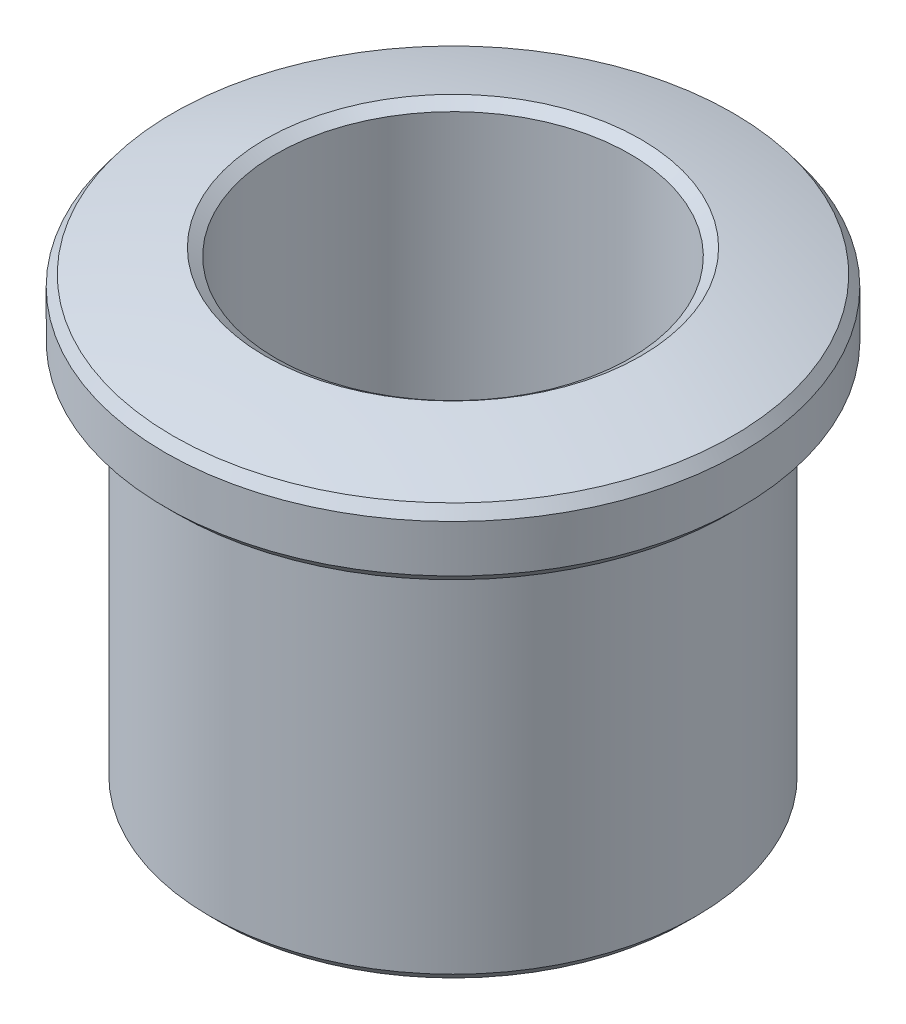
ISO-10303-21;
HEADER;
FILE_DESCRIPTION(('STEP AP214'),'2;1');
FILE_NAME('part.step','',(''),(''),'','','');
FILE_SCHEMA(('AUTOMOTIVE_DESIGN { 1 0 10303 214 1 1 1 1 }'));
ENDSEC;
DATA;
#1=APPLICATION_CONTEXT('core data for automotive mechanical design processes');
#2=APPLICATION_PROTOCOL_DEFINITION('international standard','automotive_design',2000,#1);
#3=PRODUCT_CONTEXT('',#1,'mechanical');
#4=PRODUCT('Part','Part','',(#3));
#5=PRODUCT_RELATED_PRODUCT_CATEGORY('part','',(#4));
#6=PRODUCT_DEFINITION_FORMATION('','',#4);
#7=PRODUCT_DEFINITION_CONTEXT('part definition',#1,'design');
#8=PRODUCT_DEFINITION('design','',#6,#7);
#9=PRODUCT_DEFINITION_SHAPE('','',#8);
#10=(LENGTH_UNIT() NAMED_UNIT(*) SI_UNIT(.MILLI.,.METRE.));
#11=(NAMED_UNIT(*) PLANE_ANGLE_UNIT() SI_UNIT($,.RADIAN.));
#12=(NAMED_UNIT(*) SI_UNIT($,.STERADIAN.) SOLID_ANGLE_UNIT());
#13=UNCERTAINTY_MEASURE_WITH_UNIT(LENGTH_MEASURE(1.E-05),#10,'distance_accuracy_value','');
#14=(GEOMETRIC_REPRESENTATION_CONTEXT(3) GLOBAL_UNCERTAINTY_ASSIGNED_CONTEXT((#13)) GLOBAL_UNIT_ASSIGNED_CONTEXT((#10,
#11,#12)) REPRESENTATION_CONTEXT('',''));
#15=CARTESIAN_POINT('',(0.,0.,0.));
#16=DIRECTION('',(0.,0.,1.));
#17=DIRECTION('',(1.,0.,0.));
#18=AXIS2_PLACEMENT_3D('',#15,#16,#17);
#19=CARTESIAN_POINT('',(0.,20.,0.));
#20=DIRECTION('',(0.,-1.,0.));
#21=DIRECTION('',(0.,0.,-1.));
#22=AXIS2_PLACEMENT_3D('',#19,#20,#21);
#23=CYLINDRICAL_SURFACE('',#22,13.);
#24=CARTESIAN_POINT('',(0.,17.5,0.));
#25=DIRECTION('',(0.,-1.,0.));
#26=DIRECTION('',(0.,0.,-1.));
#27=AXIS2_PLACEMENT_3D('',#24,#25,#26);
#28=CIRCLE('',#27,13.);
#29=CARTESIAN_POINT('',(0.,17.5,-13.));
#30=VERTEX_POINT('',#29);
#31=EDGE_CURVE('E56',#30,#30,#28,.F.);
#32=ORIENTED_EDGE('',*,*,#31,.T.);
#33=EDGE_LOOP('',(#32));
#34=FACE_BOUND('',#33,.T.);
#35=CARTESIAN_POINT('',(0.,19.6316890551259,0.));
#36=DIRECTION('',(0.,1.,0.));
#37=DIRECTION('',(0.,0.,1.));
#38=AXIS2_PLACEMENT_3D('',#35,#36,#37);
#39=CIRCLE('',#38,13.);
#40=CARTESIAN_POINT('',(0.,19.6316890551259,13.));
#41=VERTEX_POINT('',#40);
#42=EDGE_CURVE('E59',#41,#41,#39,.F.);
#43=ORIENTED_EDGE('',*,*,#42,.T.);
#44=EDGE_LOOP('',(#43));
#45=FACE_BOUND('',#44,.T.);
#46=ADVANCED_FACE('F27',(#34,#45),#23,.T.);
#47=CARTESIAN_POINT('',(0.,0.,0.));
#48=DIRECTION('',(0.,1.,0.));
#49=DIRECTION('',(0.,0.,1.));
#50=AXIS2_PLACEMENT_3D('',#47,#48,#49);
#51=PLANE('',#50);
#52=CARTESIAN_POINT('',(0.,0.,0.));
#53=DIRECTION('',(0.,1.,0.));
#54=DIRECTION('',(0.,0.,1.));
#55=AXIS2_PLACEMENT_3D('',#52,#53,#54);
#56=CIRCLE('',#55,10.5);
#57=CARTESIAN_POINT('',(0.,0.,10.5));
#58=VERTEX_POINT('',#57);
#59=EDGE_CURVE('E47',#58,#58,#56,.F.);
#60=ORIENTED_EDGE('',*,*,#59,.T.);
#61=EDGE_LOOP('',(#60));
#62=FACE_BOUND('',#61,.T.);
#63=CARTESIAN_POINT('',(0.,0.,0.));
#64=DIRECTION('',(0.,1.,0.));
#65=DIRECTION('',(0.,0.,1.));
#66=AXIS2_PLACEMENT_3D('',#63,#64,#65);
#67=CIRCLE('',#66,8.5);
#68=CARTESIAN_POINT('',(0.,0.,8.5));
#69=VERTEX_POINT('',#68);
#70=EDGE_CURVE('E50',#69,#69,#67,.T.);
#71=ORIENTED_EDGE('',*,*,#70,.T.);
#72=EDGE_LOOP('',(#71));
#73=FACE_BOUND('',#72,.T.);
#74=ADVANCED_FACE('F85',(#62,#73),#51,.F.);
#75=CARTESIAN_POINT('',(0.,-21.25,0.));
#76=DIRECTION('',(0.,0.,1.));
#77=DIRECTION('',(1.,0.,0.));
#78=AXIS2_PLACEMENT_3D('',#75,#76,#77);
#79=SPHERICAL_SURFACE('',#78,43.25);
#80=CARTESIAN_POINT('',(0.,-21.25,0.));
#81=DIRECTION('',(0.,-1.,0.));
#82=DIRECTION('',(0.,0.,-1.));
#83=AXIS2_PLACEMENT_3D('',#80,#81,#82);
#84=SPHERICAL_SURFACE('',#83,43.25);
#85=CARTESIAN_POINT('',(0.,21.1589112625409,0.));
#86=DIRECTION('',(0.,-1.,0.));
#87=DIRECTION('',(0.,0.,-1.));
#88=AXIS2_PLACEMENT_3D('',#85,#86,#87);
#89=CIRCLE('',#88,8.48803543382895);
#90=CARTESIAN_POINT('',(0.,21.1589112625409,-8.48803543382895));
#91=VERTEX_POINT('',#90);
#92=EDGE_CURVE('E10',#91,#91,#89,.T.);
#93=ORIENTED_EDGE('',*,*,#92,.T.);
#94=EDGE_LOOP('',(#93));
#95=FACE_BOUND('',#94,.T.);
#96=CARTESIAN_POINT('',(0.,20.1098374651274,0.));
#97=DIRECTION('',(0.,-1.,0.));
#98=DIRECTION('',(0.,0.,-1.));
#99=AXIS2_PLACEMENT_3D('',#96,#97,#98);
#100=CIRCLE('',#99,12.6461988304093);
#101=CARTESIAN_POINT('',(0.,20.1098374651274,-12.6461988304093));
#102=VERTEX_POINT('',#101);
#103=EDGE_CURVE('E53',#102,#102,#100,.F.);
#104=ORIENTED_EDGE('',*,*,#103,.T.);
#105=EDGE_LOOP('',(#104));
#106=FACE_BOUND('',#105,.T.);
#107=ADVANCED_FACE('F29',(#95,#106),#84,.T.);
#108=CARTESIAN_POINT('',(0.,0.,0.));
#109=DIRECTION('',(0.,-1.,0.));
#110=DIRECTION('',(0.,0.,-1.));
#111=AXIS2_PLACEMENT_3D('',#108,#109,#110);
#112=CYLINDRICAL_SURFACE('',#111,7.99999999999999);
#113=CARTESIAN_POINT('',(0.,20.8254896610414,0.));
#114=DIRECTION('',(0.,1.,0.));
#115=DIRECTION('',(0.,0.,1.));
#116=AXIS2_PLACEMENT_3D('',#113,#114,#115);
#117=CIRCLE('',#116,7.99999999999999);
#118=CARTESIAN_POINT('',(0.,20.8254896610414,7.99999999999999));
#119=VERTEX_POINT('',#118);
#120=EDGE_CURVE('E34',#119,#119,#117,.T.);
#121=ORIENTED_EDGE('',*,*,#120,.T.);
#122=EDGE_LOOP('',(#121));
#123=FACE_BOUND('',#122,.T.);
#124=CARTESIAN_POINT('',(0.,0.500000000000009,0.));
#125=DIRECTION('',(0.,1.,0.));
#126=DIRECTION('',(0.,0.,1.));
#127=AXIS2_PLACEMENT_3D('',#124,#125,#126);
#128=CIRCLE('',#127,7.99999999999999);
#129=CARTESIAN_POINT('',(0.,0.500000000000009,7.99999999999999));
#130=VERTEX_POINT('',#129);
#131=EDGE_CURVE('E38',#130,#130,#128,.F.);
#132=ORIENTED_EDGE('',*,*,#131,.T.);
#133=EDGE_LOOP('',(#132));
#134=FACE_BOUND('',#133,.T.);
#135=ADVANCED_FACE('F73',(#123,#134),#112,.F.);
#136=CARTESIAN_POINT('',(0.,17.,0.));
#137=DIRECTION('',(0.,-1.,0.));
#138=DIRECTION('',(0.,0.,-1.));
#139=AXIS2_PLACEMENT_3D('',#136,#137,#138);
#140=PLANE('',#139);
#141=CARTESIAN_POINT('',(0.,17.,0.));
#142=DIRECTION('',(0.,-1.,0.));
#143=DIRECTION('',(0.,0.,-1.));
#144=AXIS2_PLACEMENT_3D('',#141,#142,#143);
#145=CIRCLE('',#144,12.5);
#146=CARTESIAN_POINT('',(0.,17.,-12.5));
#147=VERTEX_POINT('',#146);
#148=EDGE_CURVE('E62',#147,#147,#145,.T.);
#149=ORIENTED_EDGE('',*,*,#148,.T.);
#150=EDGE_LOOP('',(#149));
#151=FACE_BOUND('',#150,.T.);
#152=CARTESIAN_POINT('',(0.,17.,0.));
#153=DIRECTION('',(0.,-1.,0.));
#154=DIRECTION('',(0.,0.,-1.));
#155=AXIS2_PLACEMENT_3D('',#152,#153,#154);
#156=CIRCLE('',#155,11.);
#157=CARTESIAN_POINT('',(0.,17.,-11.));
#158=VERTEX_POINT('',#157);
#159=EDGE_CURVE('E65',#158,#158,#156,.T.);
#160=ORIENTED_EDGE('',*,*,#159,.F.);
#161=EDGE_LOOP('',(#160));
#162=FACE_BOUND('',#161,.T.);
#163=ADVANCED_FACE('F71',(#151,#162),#140,.T.);
#164=CARTESIAN_POINT('',(0.,17.,0.));
#165=DIRECTION('',(0.,-1.,0.));
#166=DIRECTION('',(0.,0.,-1.));
#167=AXIS2_PLACEMENT_3D('',#164,#165,#166);
#168=CYLINDRICAL_SURFACE('',#167,11.);
#169=CARTESIAN_POINT('',(0.,0.500000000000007,0.));
#170=DIRECTION('',(0.,1.,0.));
#171=DIRECTION('',(0.,0.,1.));
#172=AXIS2_PLACEMENT_3D('',#169,#170,#171);
#173=CIRCLE('',#172,11.);
#174=CARTESIAN_POINT('',(0.,0.500000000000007,11.));
#175=VERTEX_POINT('',#174);
#176=EDGE_CURVE('E42',#175,#175,#173,.T.);
#177=ORIENTED_EDGE('',*,*,#176,.T.);
#178=EDGE_LOOP('',(#177));
#179=FACE_BOUND('',#178,.T.);
#180=ORIENTED_EDGE('',*,*,#159,.T.);
#181=EDGE_LOOP('',(#180));
#182=FACE_BOUND('',#181,.T.);
#183=ADVANCED_FACE('F69',(#179,#182),#168,.T.);
#184=CARTESIAN_POINT('',(0.,17.,0.));
#185=DIRECTION('',(0.,1.,0.));
#186=DIRECTION('',(0.,0.,1.));
#187=AXIS2_PLACEMENT_3D('',#184,#185,#186);
#188=CONICAL_SURFACE('',#187,12.5,0.785398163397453);
#189=ORIENTED_EDGE('',*,*,#31,.F.);
#190=EDGE_LOOP('',(#189));
#191=FACE_BOUND('',#190,.T.);
#192=ORIENTED_EDGE('',*,*,#148,.F.);
#193=EDGE_LOOP('',(#192));
#194=FACE_BOUND('',#193,.T.);
#195=ADVANCED_FACE('F80',(#191,#194),#188,.T.);
#196=CARTESIAN_POINT('',(0.,20.1098374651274,0.));
#197=DIRECTION('',(0.,-1.,0.));
#198=DIRECTION('',(0.,0.,-1.));
#199=AXIS2_PLACEMENT_3D('',#196,#197,#198);
#200=CONICAL_SURFACE('',#199,12.6461988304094,0.637031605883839);
#201=ORIENTED_EDGE('',*,*,#42,.F.);
#202=EDGE_LOOP('',(#201));
#203=FACE_BOUND('',#202,.T.);
#204=ORIENTED_EDGE('',*,*,#103,.F.);
#205=EDGE_LOOP('',(#204));
#206=FACE_BOUND('',#205,.T.);
#207=ADVANCED_FACE('F96',(#203,#206),#200,.T.);
#208=CARTESIAN_POINT('',(0.,0.,0.));
#209=DIRECTION('',(0.,1.,0.));
#210=DIRECTION('',(0.,0.,1.));
#211=AXIS2_PLACEMENT_3D('',#208,#209,#210);
#212=CONICAL_SURFACE('',#211,10.5,0.785398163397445);
#213=ORIENTED_EDGE('',*,*,#176,.F.);
#214=EDGE_LOOP('',(#213));
#215=FACE_BOUND('',#214,.T.);
#216=ORIENTED_EDGE('',*,*,#59,.F.);
#217=EDGE_LOOP('',(#216));
#218=FACE_BOUND('',#217,.T.);
#219=ADVANCED_FACE('F99',(#215,#218),#212,.T.);
#220=CARTESIAN_POINT('',(0.,0.500000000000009,0.));
#221=DIRECTION('',(0.,-1.,0.));
#222=DIRECTION('',(0.,0.,-1.));
#223=AXIS2_PLACEMENT_3D('',#220,#221,#222);
#224=CONICAL_SURFACE('',#223,7.99999999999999,0.785398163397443);
#225=ORIENTED_EDGE('',*,*,#70,.F.);
#226=EDGE_LOOP('',(#225));
#227=FACE_BOUND('',#226,.T.);
#228=ORIENTED_EDGE('',*,*,#131,.F.);
#229=EDGE_LOOP('',(#228));
#230=FACE_BOUND('',#229,.T.);
#231=ADVANCED_FACE('F148',(#227,#230),#224,.F.);
#232=CARTESIAN_POINT('',(0.,20.8254896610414,0.));
#233=DIRECTION('',(0.,1.,0.));
#234=DIRECTION('',(0.,0.,1.));
#235=AXIS2_PLACEMENT_3D('',#232,#233,#234);
#236=CONICAL_SURFACE('',#235,7.99999999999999,0.971440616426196);
#237=ORIENTED_EDGE('',*,*,#92,.F.);
#238=EDGE_LOOP('',(#237));
#239=FACE_BOUND('',#238,.T.);
#240=ORIENTED_EDGE('',*,*,#120,.F.);
#241=EDGE_LOOP('',(#240));
#242=FACE_BOUND('',#241,.T.);
#243=ADVANCED_FACE('F158',(#239,#242),#236,.F.);
#244=CLOSED_SHELL('',(#46,#74,#107,#135,#163,#183,#195,#207,#219,#231,#243));
#245=MANIFOLD_SOLID_BREP('B2',#244);
#246=ADVANCED_BREP_SHAPE_REPRESENTATION('',(#18,#245),#14);
#247=SHAPE_DEFINITION_REPRESENTATION(#9,#246);
ENDSEC;
END-ISO-10303-21;
